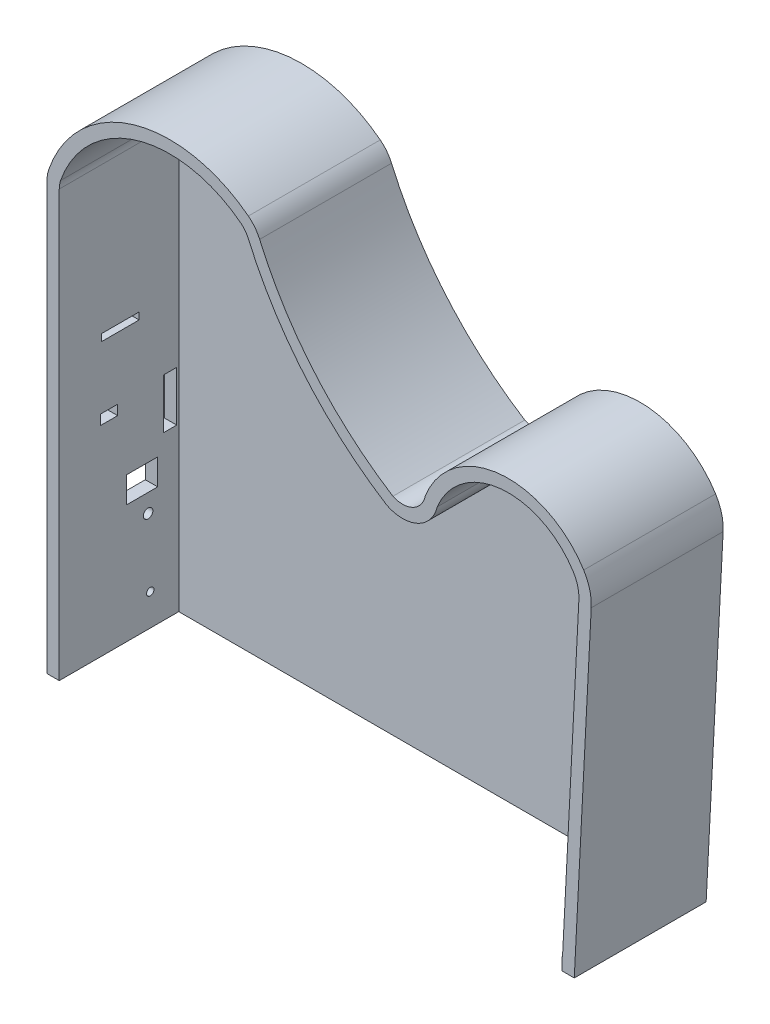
from build123d import *

# Parameters (mm, degrees)
ESQUISSE1_W              = 500
ESQUISSE1_H              = 500
BOSS_EXTRU_1_DEPTH       = 262.314415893
ESQUISSE3_W              = 148.269213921
ESQUISSE3_H              = 578.53679596
ENL_V_MAT_EXTRU_2_DEPTH  = 757.613225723
ESQUISSE4_W              = 85.476810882
ESQUISSE4_H              = 573.932722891
ENL_V_MAT_EXTRU_3_DEPTH  = 757.613225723
ESQUISSE5_W              = 476.840708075
ESQUISSE5_H              = 120
ENL_V_MAT_EXTRU_4_DEPTH  = 751.774854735
ENL_V_MAT_EXTRU_7_DEPTH  = 751.774854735
CONG_3_R                 = 20
ENL_V_MAT_EXTRU_10_DEPTH = 751.774854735
CONG_4_R                 = 20
ENL_V_MAT_EXTRU_12_DEPTH = 747.450330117
CONG_5_R                 = 30
COQUE1_T                 = 10
ESQUISSE11_W             = 405.869257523
ESQUISSE11_H             = 262.314415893
ENL_V_MAT_EXTRU_13_DEPTH = 10
ESQUISSE12_W             = 165.81
ESQUISSE12_H             = 126.9
ENL_V_MAT_EXTRU_16_DEPTH = 10
ESQUISSE13_W             = 165.81
ESQUISSE13_H             = 126.9
ENL_V_MAT_EXTRU_17_DEPTH = 10
ESQUISSE14_R             = 3.85
ENL_V_MAT_EXTRU_18_DEPTH = 10
ESQUISSE15_W             = 25
ESQUISSE15_H             = 21
ENL_V_MAT_EXTRU_19_DEPTH = 10
ESQUISSE16_W             = 14
ESQUISSE16_H             = 8
ENL_V_MAT_EXTRU_20_DEPTH = 10
ESQUISSE17_W             = 10.8
ESQUISSE17_H             = 40.4
ENL_V_MAT_EXTRU_21_DEPTH = 10
ESQUISSE18_W             = 30.42
ESQUISSE18_H             = 5.6
ENL_V_MAT_EXTRU_22_DEPTH = 10
ESQUISSE19_R             = 3
ENL_V_MAT_EXTRU_23_DEPTH = 10
ESQUISSE21_W             = 160.35037154
ESQUISSE21_H             = 113.954484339
ENL_V_MAT_EXTRU_26_DEPTH = 703.699773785
ESQUISSE22_W             = 30.556509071
ESQUISSE22_H             = 29.839921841
ENL_V_MAT_EXTRU_27_DEPTH = 10
ESQUISSE23_W             = 186.404253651
ESQUISSE23_H             = 417.373934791
ENL_V_MAT_EXTRU_28_DEPTH = 696.040759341
ESQUISSE24_W             = 99.337176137
ESQUISSE24_H             = 80.244940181
ENL_V_MAT_EXTRU_29_DEPTH = 668.352663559


with BuildPart() as part:
    # Esquisse1 → Boss.-Extru.1 (new body)
    with BuildSketch(Plane.XY):
        with Locations((284.312098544, 217.081686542)):
            Rectangle(ESQUISSE1_W, ESQUISSE1_H)
    extrude(amount=BOSS_EXTRU_1_DEPTH)

    # Esquisse3 → Enl_v. mat.-Extru.2 (cut, through all)
    with BuildSketch(Plane.XY.offset(262.314415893)):
        with Locations((31.877491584, 235.76785395)):
            Rectangle(ESQUISSE3_W, ESQUISSE3_H)
    extrude(amount=-ENL_V_MAT_EXTRU_2_DEPTH, mode=Mode.SUBTRACT)

    # Esquisse4 → Enl_v. mat.-Extru.3 (cut, through all)
    with BuildSketch(Plane.XY.offset(262.314415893)):
        with Locations((568.750503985, 214.860708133)):
            Rectangle(ESQUISSE4_W, ESQUISSE4_H)
    extrude(amount=-ENL_V_MAT_EXTRU_3_DEPTH, mode=Mode.SUBTRACT)

    # Esquisse5 → Enl_v. mat.-Extru.4 (cut, through all)
    with BuildSketch(Plane.XY.offset(262.314415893)):
        with Locations((307.479368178, -2.918313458)):
            Rectangle(ESQUISSE5_W, ESQUISSE5_H)
    extrude(amount=-ENL_V_MAT_EXTRU_4_DEPTH, mode=Mode.SUBTRACT)

    # Esquisse6 → Enl_v. mat.-Extru.7 (cut, through all)
    with BuildSketch(Plane.XY.offset(262.314415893)):
        with BuildLine():
            Line((284.55551216, 467.081686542), (106.012098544, 467.081686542))
            Line((106.012098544, 467.081686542), (106.012098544, 394.040451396))
            ThreePointArc((106.012098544, 394.040451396), (195.294450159, 460.098373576), (284.55551216, 394.011686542))
            Line((284.55551216, 394.011686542), (284.55551216, 467.081686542))
        make_face()
    extrude(amount=-ENL_V_MAT_EXTRU_7_DEPTH, mode=Mode.SUBTRACT)

    # Cong_3
    cong_3_edges = [part.edges().sort_by_distance(p)[0] for p in [
        (106.012098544, 394.040451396, 131.157207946),
    ]]
    fillet(cong_3_edges, radius=CONG_3_R)

    # Esquisse7 → Enl_v. mat.-Extru.10 (cut, through all)
    with BuildSketch(Plane.XY.offset(262.314415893)):
        with BuildLine():
            ThreePointArc((411.181665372, 321.164414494), (468.596881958, 359.842058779), (526.012098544, 321.164414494))
            Line((526.012098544, 321.164414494), (526.012098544, 467.081686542))
            Line((526.012098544, 467.081686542), (284.55551216, 467.081686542))
            Line((284.55551216, 467.081686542), (256.811880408, 436.946154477))
            ThreePointArc((256.811880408, 436.946154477), (303.248774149, 360.631834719), (370.623095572, 301.972126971))
            ThreePointArc((370.623095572, 301.972126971), (395.507376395, 301.83665076), (411.181665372, 321.164414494))
        make_face()
    extrude(amount=-ENL_V_MAT_EXTRU_10_DEPTH, mode=Mode.SUBTRACT)

    # Cong_4
    cong_4_edges = [part.edges().sort_by_distance(p)[0] for p in [
        (256.811880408, 436.946154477, 131.157207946),
    ]]
    fillet(cong_4_edges, radius=CONG_4_R)

    # Esquisse10 → Enl_v. mat.-Extru.12 (cut, through all)
    with BuildSketch(Plane.XY.offset(262.314415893)):
        Polygon((526.012098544, 321.164414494), (526.012098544, 57.081686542), (512.384099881, 57.081686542), align=None)
    extrude(amount=-ENL_V_MAT_EXTRU_12_DEPTH, mode=Mode.SUBTRACT)

    # Cong_5
    cong_5_edges = [part.edges().sort_by_distance(p)[0] for p in [
        (526.012098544, 321.164414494, 131.157207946),
    ]]
    fillet(cong_5_edges, radius=CONG_5_R)

    # Coque1
    coque1_openings = [part.faces().sort_by_distance(p)[0] for p in [
        (296.88555943, 225.060436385, 262.314415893),
    ]]
    offset(amount=COQUE1_T, openings=coque1_openings, kind=Kind.INTERSECTION)

    # Esquisse11 → Enl_v. mat.-Extru.13 (cut)
    with BuildSketch(Plane.XZ.offset(-47.081686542)):
        with Locations((308.946727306, 131.157207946)):
            Rectangle(ESQUISSE11_W, ESQUISSE11_H)
    extrude(amount=-ENL_V_MAT_EXTRU_13_DEPTH, mode=Mode.SUBTRACT)

    # Esquisse12 → Enl_v. mat.-Extru.16 (cut)
    with BuildSketch(Plane(origin=(518.072036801, -26.735126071, 0), x_dir=(0, 0, -1), z_dir=(0.9986711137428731, -0.05153645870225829, 0))):
        with Locations((-179.409415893, 147.693136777)):
            Rectangle(ESQUISSE12_W, ESQUISSE12_H)
    extrude(amount=-ENL_V_MAT_EXTRU_16_DEPTH, mode=Mode.SUBTRACT)

    # Esquisse13 → Enl_v. mat.-Extru.17 (cut)
    with BuildSketch(Plane.ZY.offset(-96.012098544)):
        with Locations((179.409415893, 120.531686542)):
            Rectangle(ESQUISSE13_W, ESQUISSE13_H)
    extrude(amount=-ENL_V_MAT_EXTRU_17_DEPTH, mode=Mode.SUBTRACT)

    # Esquisse14 → Enl_v. mat.-Extru.18 (cut)
    with BuildSketch(Plane.ZY.offset(-96.012098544)):
        with Locations(Location((24.75, 128.171686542, 0), (0, 0, 270))):
            Circle(ESQUISSE14_R)
    extrude(amount=-ENL_V_MAT_EXTRU_18_DEPTH, mode=Mode.SUBTRACT)

    # Esquisse15 → Enl_v. mat.-Extru.19 (cut)
    with BuildSketch(Plane.ZY.offset(-96.012098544)):
        with Locations((29.5, 153.351686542)):
            Rectangle(ESQUISSE15_W, ESQUISSE15_H)
    extrude(amount=-ENL_V_MAT_EXTRU_19_DEPTH, mode=Mode.SUBTRACT)

    # Esquisse16 → Enl_v. mat.-Extru.20 (cut)
    with BuildSketch(Plane.ZY.offset(-96.012098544)):
        with Locations((56.33, 212.831686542)):
            Rectangle(ESQUISSE16_W, ESQUISSE16_H)
    extrude(amount=-ENL_V_MAT_EXTRU_20_DEPTH, mode=Mode.SUBTRACT)

    # Esquisse17 → Enl_v. mat.-Extru.21 (cut)
    with BuildSketch(Plane.ZY.offset(-96.012098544)):
        with Locations((7.05, 198.581686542)):
            Rectangle(ESQUISSE17_W, ESQUISSE17_H)
    extrude(amount=-ENL_V_MAT_EXTRU_21_DEPTH, mode=Mode.SUBTRACT)

    # Esquisse18 → Enl_v. mat.-Extru.22 (cut)
    with BuildSketch(Plane.ZY.offset(-96.012098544)):
        with Locations((47.21, 269.881686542)):
            Rectangle(ESQUISSE18_W, ESQUISSE18_H)
    extrude(amount=-ENL_V_MAT_EXTRU_22_DEPTH, mode=Mode.SUBTRACT)

    # Esquisse19 → Enl_v. mat.-Extru.23 (cut)
    with BuildSketch(Plane.ZY.offset(-96.012098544)):
        with Locations(Location((23, 72.641686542, 0), (0, 0, 270))):
            Circle(ESQUISSE19_R)
    extrude(amount=-ENL_V_MAT_EXTRU_23_DEPTH, mode=Mode.SUBTRACT)

    # Esquisse21 → Enl_v. mat.-Extru.26 (cut, through all)
    with BuildSketch(Plane(origin=(518.072036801, -26.735126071, 0), x_dir=(0, 0, -1), z_dir=(0.9986711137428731, -0.05153645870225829, 0))):
        with Locations((-256.489601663, 66.891871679)):
            Rectangle(ESQUISSE21_W, ESQUISSE21_H)
    extrude(amount=-ENL_V_MAT_EXTRU_26_DEPTH, mode=Mode.SUBTRACT)

    # Esquisse22 → Enl_v. mat.-Extru.27 (cut)
    with BuildSketch(Plane.XZ.offset(-47.081686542)):
        with Locations((104.388446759, 171.062339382)):
            Rectangle(ESQUISSE22_W, ESQUISSE22_H)
    extrude(amount=-ENL_V_MAT_EXTRU_27_DEPTH, mode=Mode.SUBTRACT)

    # Esquisse23 → Enl_v. mat.-Extru.28 (cut, through all)
    with BuildSketch(Plane.ZY.offset(-96.012098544)):
        with Locations((189.706542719, 346.321242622)):
            Rectangle(ESQUISSE23_W, ESQUISSE23_H)
    extrude(amount=-ENL_V_MAT_EXTRU_28_DEPTH, mode=Mode.SUBTRACT)

    # Esquisse24 → Enl_v. mat.-Extru.29 (cut, through all)
    with BuildSketch(Plane.ZY.offset(-96.012098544)):
        with Locations((146.173003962, 60.96552373)):
            Rectangle(ESQUISSE24_W, ESQUISSE24_H)
    extrude(amount=-ENL_V_MAT_EXTRU_29_DEPTH, mode=Mode.SUBTRACT)


solid = part.part
